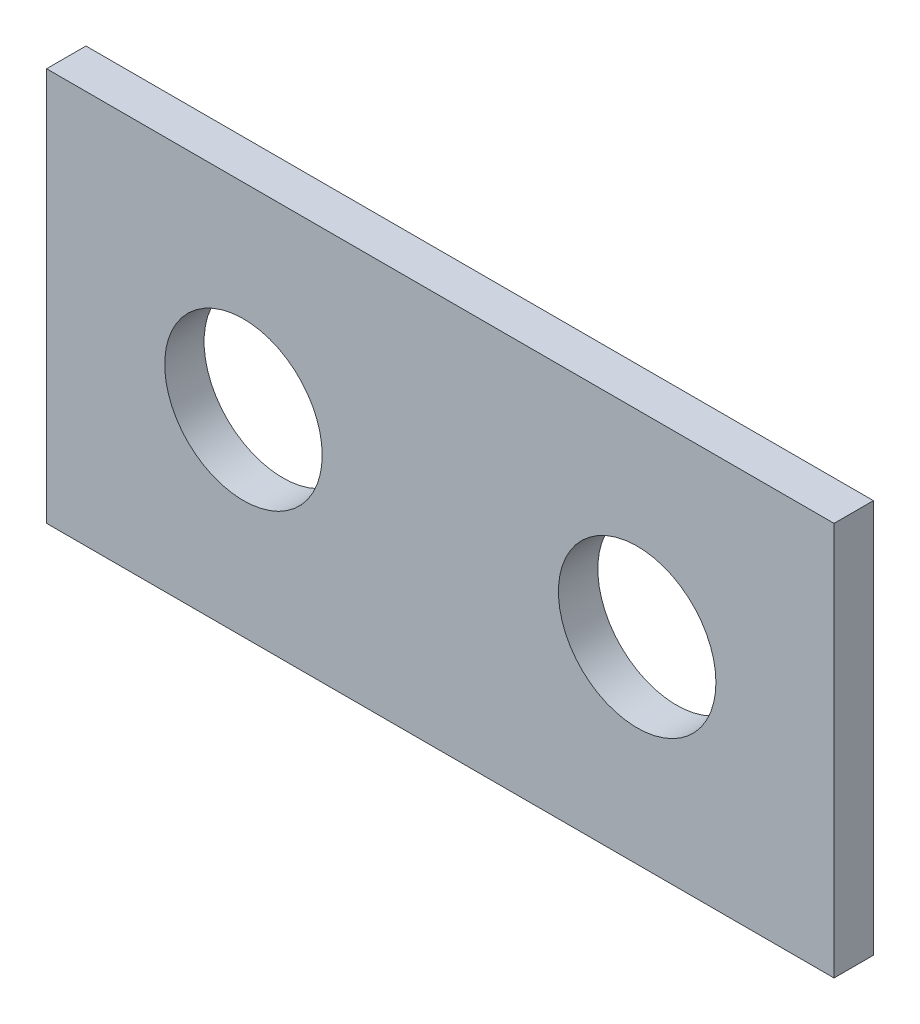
ISO-10303-21;
HEADER;
FILE_DESCRIPTION(('STEP AP214'),'2;1');
FILE_NAME('part.step','',(''),(''),'','','');
FILE_SCHEMA(('AUTOMOTIVE_DESIGN { 1 0 10303 214 1 1 1 1 }'));
ENDSEC;
DATA;
#1=APPLICATION_CONTEXT('core data for automotive mechanical design processes');
#2=APPLICATION_PROTOCOL_DEFINITION('international standard','automotive_design',2000,#1);
#3=PRODUCT_CONTEXT('',#1,'mechanical');
#4=PRODUCT('Part','Part','',(#3));
#5=PRODUCT_RELATED_PRODUCT_CATEGORY('part','',(#4));
#6=PRODUCT_DEFINITION_FORMATION('','',#4);
#7=PRODUCT_DEFINITION_CONTEXT('part definition',#1,'design');
#8=PRODUCT_DEFINITION('design','',#6,#7);
#9=PRODUCT_DEFINITION_SHAPE('','',#8);
#10=(LENGTH_UNIT() NAMED_UNIT(*) SI_UNIT(.MILLI.,.METRE.));
#11=(NAMED_UNIT(*) PLANE_ANGLE_UNIT() SI_UNIT($,.RADIAN.));
#12=(NAMED_UNIT(*) SI_UNIT($,.STERADIAN.) SOLID_ANGLE_UNIT());
#13=UNCERTAINTY_MEASURE_WITH_UNIT(LENGTH_MEASURE(1.E-05),#10,'distance_accuracy_value','');
#14=(GEOMETRIC_REPRESENTATION_CONTEXT(3) GLOBAL_UNCERTAINTY_ASSIGNED_CONTEXT((#13)) GLOBAL_UNIT_ASSIGNED_CONTEXT((#10,
#11,#12)) REPRESENTATION_CONTEXT('',''));
#15=CARTESIAN_POINT('',(0.,0.,0.));
#16=DIRECTION('',(0.,0.,1.));
#17=DIRECTION('',(1.,0.,0.));
#18=AXIS2_PLACEMENT_3D('',#15,#16,#17);
#19=CARTESIAN_POINT('',(-50.,-25.,5.));
#20=DIRECTION('',(1.,0.,0.));
#21=DIRECTION('',(0.,0.,-1.));
#22=AXIS2_PLACEMENT_3D('',#19,#20,#21);
#23=PLANE('',#22);
#24=DIRECTION('',(0.,-1.,0.));
#25=VECTOR('',#24,1.);
#26=CARTESIAN_POINT('',(-50.,-25.,0.));
#27=LINE('',#26,#25);
#28=CARTESIAN_POINT('',(-50.,25.,0.));
#29=VERTEX_POINT('',#28);
#30=CARTESIAN_POINT('',(-50.,-25.,0.));
#31=VERTEX_POINT('',#30);
#32=EDGE_CURVE('E95',#29,#31,#27,.T.);
#33=ORIENTED_EDGE('',*,*,#32,.T.);
#34=DIRECTION('',(0.,0.,-1.));
#35=VECTOR('',#34,1.);
#36=CARTESIAN_POINT('',(-50.,-25.,5.));
#37=LINE('',#36,#35);
#38=CARTESIAN_POINT('',(-50.,-25.,5.));
#39=VERTEX_POINT('',#38);
#40=EDGE_CURVE('E11',#39,#31,#37,.T.);
#41=ORIENTED_EDGE('',*,*,#40,.F.);
#42=DIRECTION('',(0.,-1.,0.));
#43=VECTOR('',#42,1.);
#44=CARTESIAN_POINT('',(-50.,-25.,5.));
#45=LINE('',#44,#43);
#46=CARTESIAN_POINT('',(-50.,25.,5.));
#47=VERTEX_POINT('',#46);
#48=EDGE_CURVE('E83',#47,#39,#45,.T.);
#49=ORIENTED_EDGE('',*,*,#48,.F.);
#50=DIRECTION('',(0.,0.,-1.));
#51=VECTOR('',#50,1.);
#52=CARTESIAN_POINT('',(-50.,25.,5.));
#53=LINE('',#52,#51);
#54=EDGE_CURVE('E91',#47,#29,#53,.T.);
#55=ORIENTED_EDGE('',*,*,#54,.T.);
#56=EDGE_LOOP('',(#33,#41,#49,#55));
#57=FACE_BOUND('',#56,.T.);
#58=ADVANCED_FACE('F32',(#57),#23,.F.);
#59=CARTESIAN_POINT('',(-50.,-25.,5.));
#60=DIRECTION('',(0.,1.,0.));
#61=DIRECTION('',(0.,0.,1.));
#62=AXIS2_PLACEMENT_3D('',#59,#60,#61);
#63=PLANE('',#62);
#64=DIRECTION('',(1.,0.,0.));
#65=VECTOR('',#64,1.);
#66=CARTESIAN_POINT('',(-50.,-25.,0.));
#67=LINE('',#66,#65);
#68=CARTESIAN_POINT('',(50.,-25.,0.));
#69=VERTEX_POINT('',#68);
#70=EDGE_CURVE('E87',#31,#69,#67,.T.);
#71=ORIENTED_EDGE('',*,*,#70,.T.);
#72=DIRECTION('',(0.,0.,-1.));
#73=VECTOR('',#72,1.);
#74=CARTESIAN_POINT('',(50.,-25.,5.));
#75=LINE('',#74,#73);
#76=CARTESIAN_POINT('',(50.,-25.,5.));
#77=VERTEX_POINT('',#76);
#78=EDGE_CURVE('E40',#77,#69,#75,.T.);
#79=ORIENTED_EDGE('',*,*,#78,.F.);
#80=DIRECTION('',(1.,0.,0.));
#81=VECTOR('',#80,1.);
#82=CARTESIAN_POINT('',(-50.,-25.,5.));
#83=LINE('',#82,#81);
#84=EDGE_CURVE('E78',#39,#77,#83,.T.);
#85=ORIENTED_EDGE('',*,*,#84,.F.);
#86=ORIENTED_EDGE('',*,*,#40,.T.);
#87=EDGE_LOOP('',(#71,#79,#85,#86));
#88=FACE_BOUND('',#87,.T.);
#89=ADVANCED_FACE('F86',(#88),#63,.F.);
#90=CARTESIAN_POINT('',(50.,-25.,5.));
#91=DIRECTION('',(-1.,0.,0.));
#92=DIRECTION('',(0.,0.,1.));
#93=AXIS2_PLACEMENT_3D('',#90,#91,#92);
#94=PLANE('',#93);
#95=DIRECTION('',(0.,1.,0.));
#96=VECTOR('',#95,1.);
#97=CARTESIAN_POINT('',(50.,-25.,0.));
#98=LINE('',#97,#96);
#99=CARTESIAN_POINT('',(50.,25.,0.));
#100=VERTEX_POINT('',#99);
#101=EDGE_CURVE('E65',#69,#100,#98,.T.);
#102=ORIENTED_EDGE('',*,*,#101,.T.);
#103=DIRECTION('',(0.,0.,-1.));
#104=VECTOR('',#103,1.);
#105=CARTESIAN_POINT('',(50.,25.,5.));
#106=LINE('',#105,#104);
#107=CARTESIAN_POINT('',(50.,25.,5.));
#108=VERTEX_POINT('',#107);
#109=EDGE_CURVE('E88',#108,#100,#106,.T.);
#110=ORIENTED_EDGE('',*,*,#109,.F.);
#111=DIRECTION('',(0.,1.,0.));
#112=VECTOR('',#111,1.);
#113=CARTESIAN_POINT('',(50.,-25.,5.));
#114=LINE('',#113,#112);
#115=EDGE_CURVE('E81',#77,#108,#114,.T.);
#116=ORIENTED_EDGE('',*,*,#115,.F.);
#117=ORIENTED_EDGE('',*,*,#78,.T.);
#118=EDGE_LOOP('',(#102,#110,#116,#117));
#119=FACE_BOUND('',#118,.T.);
#120=ADVANCED_FACE('F89',(#119),#94,.F.);
#121=CARTESIAN_POINT('',(-50.,25.,5.));
#122=DIRECTION('',(0.,-1.,0.));
#123=DIRECTION('',(0.,0.,-1.));
#124=AXIS2_PLACEMENT_3D('',#121,#122,#123);
#125=PLANE('',#124);
#126=DIRECTION('',(-1.,0.,0.));
#127=VECTOR('',#126,1.);
#128=CARTESIAN_POINT('',(-50.,25.,0.));
#129=LINE('',#128,#127);
#130=EDGE_CURVE('E71',#100,#29,#129,.T.);
#131=ORIENTED_EDGE('',*,*,#130,.T.);
#132=ORIENTED_EDGE('',*,*,#54,.F.);
#133=DIRECTION('',(-1.,0.,0.));
#134=VECTOR('',#133,1.);
#135=CARTESIAN_POINT('',(-50.,25.,5.));
#136=LINE('',#135,#134);
#137=EDGE_CURVE('E48',#108,#47,#136,.T.);
#138=ORIENTED_EDGE('',*,*,#137,.F.);
#139=ORIENTED_EDGE('',*,*,#109,.T.);
#140=EDGE_LOOP('',(#131,#132,#138,#139));
#141=FACE_BOUND('',#140,.T.);
#142=ADVANCED_FACE('F103',(#141),#125,.F.);
#143=CARTESIAN_POINT('',(-50.,25.,5.));
#144=DIRECTION('',(0.,0.,-1.));
#145=DIRECTION('',(-1.,0.,0.));
#146=AXIS2_PLACEMENT_3D('',#143,#144,#145);
#147=PLANE('',#146);
#148=CARTESIAN_POINT('',(-25.,0.,5.));
#149=DIRECTION('',(0.,0.,1.));
#150=DIRECTION('',(1.,0.,0.));
#151=AXIS2_PLACEMENT_3D('',#148,#149,#150);
#152=CIRCLE('',#151,10.);
#153=CARTESIAN_POINT('',(-15.,0.,5.));
#154=VERTEX_POINT('',#153);
#155=EDGE_CURVE('E115',#154,#154,#152,.T.);
#156=ORIENTED_EDGE('',*,*,#155,.F.);
#157=EDGE_LOOP('',(#156));
#158=FACE_BOUND('',#157,.T.);
#159=CARTESIAN_POINT('',(25.,0.,5.));
#160=DIRECTION('',(0.,0.,1.));
#161=DIRECTION('',(1.,0.,0.));
#162=AXIS2_PLACEMENT_3D('',#159,#160,#161);
#163=CIRCLE('',#162,10.);
#164=CARTESIAN_POINT('',(35.,0.,5.));
#165=VERTEX_POINT('',#164);
#166=EDGE_CURVE('E109',#165,#165,#163,.T.);
#167=ORIENTED_EDGE('',*,*,#166,.F.);
#168=EDGE_LOOP('',(#167));
#169=FACE_BOUND('',#168,.T.);
#170=ORIENTED_EDGE('',*,*,#48,.T.);
#171=ORIENTED_EDGE('',*,*,#84,.T.);
#172=ORIENTED_EDGE('',*,*,#115,.T.);
#173=ORIENTED_EDGE('',*,*,#137,.T.);
#174=EDGE_LOOP('',(#170,#171,#172,#173));
#175=FACE_BOUND('',#174,.T.);
#176=ADVANCED_FACE('F79',(#158,#169,#175),#147,.F.);
#177=CARTESIAN_POINT('',(-50.,25.,0.));
#178=DIRECTION('',(0.,0.,-1.));
#179=DIRECTION('',(-1.,0.,0.));
#180=AXIS2_PLACEMENT_3D('',#177,#178,#179);
#181=PLANE('',#180);
#182=CARTESIAN_POINT('',(-25.,0.,0.));
#183=DIRECTION('',(0.,0.,1.));
#184=DIRECTION('',(1.,0.,0.));
#185=AXIS2_PLACEMENT_3D('',#182,#183,#184);
#186=CIRCLE('',#185,10.);
#187=CARTESIAN_POINT('',(-15.,0.,0.));
#188=VERTEX_POINT('',#187);
#189=EDGE_CURVE('E112',#188,#188,#186,.T.);
#190=ORIENTED_EDGE('',*,*,#189,.T.);
#191=EDGE_LOOP('',(#190));
#192=FACE_BOUND('',#191,.T.);
#193=CARTESIAN_POINT('',(25.,0.,0.));
#194=DIRECTION('',(0.,0.,1.));
#195=DIRECTION('',(1.,0.,0.));
#196=AXIS2_PLACEMENT_3D('',#193,#194,#195);
#197=CIRCLE('',#196,10.);
#198=CARTESIAN_POINT('',(35.,0.,0.));
#199=VERTEX_POINT('',#198);
#200=EDGE_CURVE('E98',#199,#199,#197,.T.);
#201=ORIENTED_EDGE('',*,*,#200,.T.);
#202=EDGE_LOOP('',(#201));
#203=FACE_BOUND('',#202,.T.);
#204=ORIENTED_EDGE('',*,*,#32,.F.);
#205=ORIENTED_EDGE('',*,*,#130,.F.);
#206=ORIENTED_EDGE('',*,*,#101,.F.);
#207=ORIENTED_EDGE('',*,*,#70,.F.);
#208=EDGE_LOOP('',(#204,#205,#206,#207));
#209=FACE_BOUND('',#208,.T.);
#210=ADVANCED_FACE('F106',(#192,#203,#209),#181,.T.);
#211=CARTESIAN_POINT('',(25.,0.,0.));
#212=DIRECTION('',(0.,0.,1.));
#213=DIRECTION('',(1.,0.,0.));
#214=AXIS2_PLACEMENT_3D('',#211,#212,#213);
#215=CYLINDRICAL_SURFACE('',#214,10.);
#216=ORIENTED_EDGE('',*,*,#200,.F.);
#217=EDGE_LOOP('',(#216));
#218=FACE_BOUND('',#217,.T.);
#219=ORIENTED_EDGE('',*,*,#166,.T.);
#220=EDGE_LOOP('',(#219));
#221=FACE_BOUND('',#220,.T.);
#222=ADVANCED_FACE('F126',(#218,#221),#215,.F.);
#223=CARTESIAN_POINT('',(-25.,0.,0.));
#224=DIRECTION('',(0.,0.,1.));
#225=DIRECTION('',(1.,0.,0.));
#226=AXIS2_PLACEMENT_3D('',#223,#224,#225);
#227=CYLINDRICAL_SURFACE('',#226,10.);
#228=ORIENTED_EDGE('',*,*,#189,.F.);
#229=EDGE_LOOP('',(#228));
#230=FACE_BOUND('',#229,.T.);
#231=ORIENTED_EDGE('',*,*,#155,.T.);
#232=EDGE_LOOP('',(#231));
#233=FACE_BOUND('',#232,.T.);
#234=ADVANCED_FACE('F123',(#230,#233),#227,.F.);
#235=CLOSED_SHELL('',(#58,#89,#120,#142,#176,#210,#222,#234));
#236=MANIFOLD_SOLID_BREP('B2',#235);
#237=ADVANCED_BREP_SHAPE_REPRESENTATION('',(#18,#236),#14);
#238=SHAPE_DEFINITION_REPRESENTATION(#9,#237);
ENDSEC;
END-ISO-10303-21;
